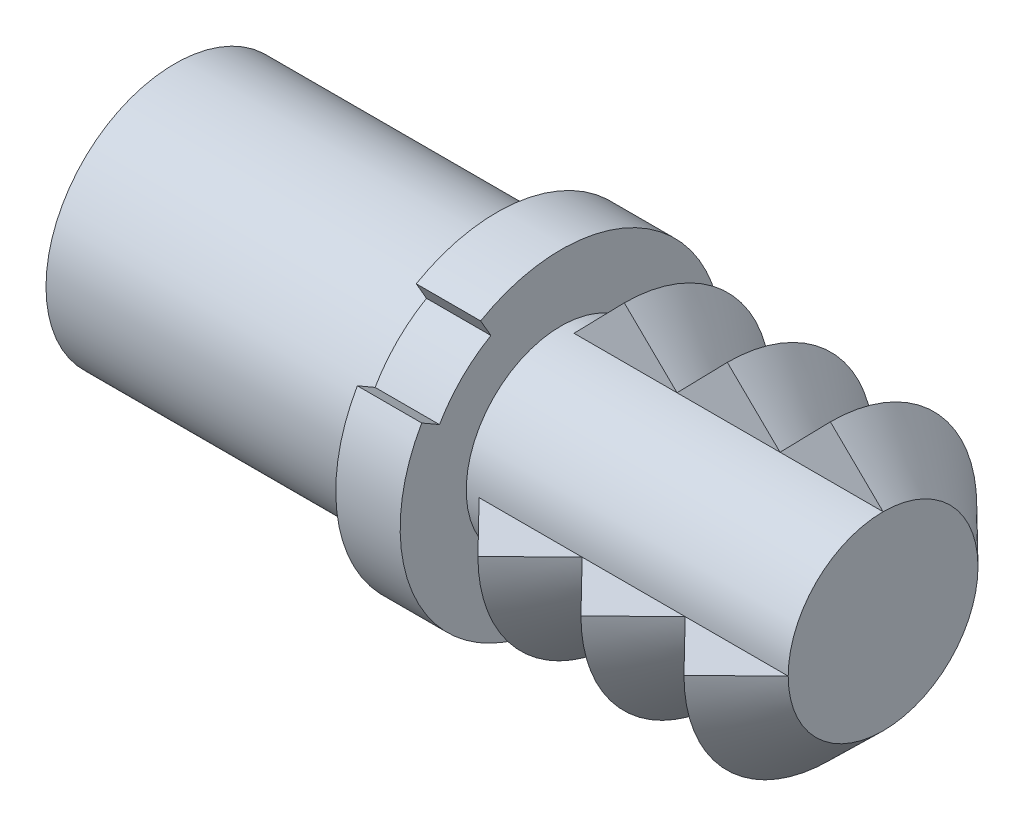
from build123d import *

# Parameters (mm, degrees)
CUT_EXTRUDE2_START = -12.446000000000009
CUT_EXTRUDE2_DEPTH = 12.446000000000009
CUT_EXTRUDE3_START = -2.54
CUT_EXTRUDE3_DEPTH = 2.54


with BuildPart() as part:
    # Sketch1 → Revolve5 (revolve)
    with BuildSketch(Plane.XY, mode=Mode.PRIVATE) as revolve5_sk:
        Polygon((18.809696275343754, -7.321311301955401), (18.809696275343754, -3.577807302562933), (16.729861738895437, -1.5463704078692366), (14.745696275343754, -3.5778073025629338), (12.665861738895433, -1.5463704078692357), (10.681696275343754, -3.5778073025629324), (8.601861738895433, -1.5463704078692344), (6.617696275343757, -3.577807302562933), (6.109696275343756, -3.5778073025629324), (6.109696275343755, -0.9713113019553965), (3.5696962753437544, -0.9713113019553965), (3.5696962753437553, -2.2413113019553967), (-9.130303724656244, -2.2413113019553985), (-9.130303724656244, -4.781311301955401), (3.5696962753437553, -4.781311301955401), (3.5696962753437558, -7.321311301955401), align=None)
    revolve(revolve5_sk.sketch.rotate(Axis((28.57365948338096, -7.321311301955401, 0), (-1, 0, 0)), 90), axis=Axis((28.57365948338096, -7.321311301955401, 0), (-1, 0, 0)))

    # Sketch3 → Cut-Extrude2 (cut)
    with BuildSketch(Plane(origin=(18.809696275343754, 0, 0), x_dir=(0, 0, -1), z_dir=(1, 0, 0)).offset(CUT_EXTRUDE2_START)):
        with BuildLine():
            Line((0, -3.577807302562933), (0, -1.5463704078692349))
            ThreePointArc((0, -1.5463704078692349), (-4.083499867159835, -3.2378114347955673), (-5.77494089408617, -7.321311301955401))
            Line((-5.77494089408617, -7.321311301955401), (-3.7435039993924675, -7.321311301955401))
            ThreePointArc((-3.7435039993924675, -7.321311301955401), (-2.6470570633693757, -4.674254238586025), (0, -3.577807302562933))
        make_face()
        with BuildLine():
            Line((0, -11.064815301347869), (2.5e-16, -13.096252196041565))
            ThreePointArc((2.5e-16, -13.096252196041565), (4.083499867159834, -11.404811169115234), (5.77494089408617, -7.321311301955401))
            Line((5.77494089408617, -7.321311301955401), (3.7435039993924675, -7.321311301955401))
            ThreePointArc((3.7435039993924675, -7.321311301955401), (2.6470570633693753, -9.968368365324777), (0, -11.064815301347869))
        make_face()
    extrude(amount=CUT_EXTRUDE2_DEPTH, mode=Mode.SUBTRACT)

    # Sketch5 → Cut-Extrude3 (cut)
    with BuildSketch(Plane(origin=(6.109696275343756, 0, 0), x_dir=(0, 0, -1), z_dir=(1, 0, 0)).offset(CUT_EXTRUDE3_START)):
        with BuildLine():
            Line((-5.499261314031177, -4.146311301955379), (-4.7992505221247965, -4.550462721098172))
            ThreePointArc((-4.7992505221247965, -4.550462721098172), (-3.9185716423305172, -3.402739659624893), (-2.770848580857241, -2.5220607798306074))
            Line((-2.770848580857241, -2.5220607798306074), (-3.1750000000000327, -1.8220499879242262))
            ThreePointArc((-3.1750000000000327, -1.8220499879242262), (-4.490128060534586, -2.8311832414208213), (-5.499261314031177, -4.146311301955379))
        make_face()
    extrude(amount=CUT_EXTRUDE3_DEPTH, mode=Mode.SUBTRACT)


solid = part.part
